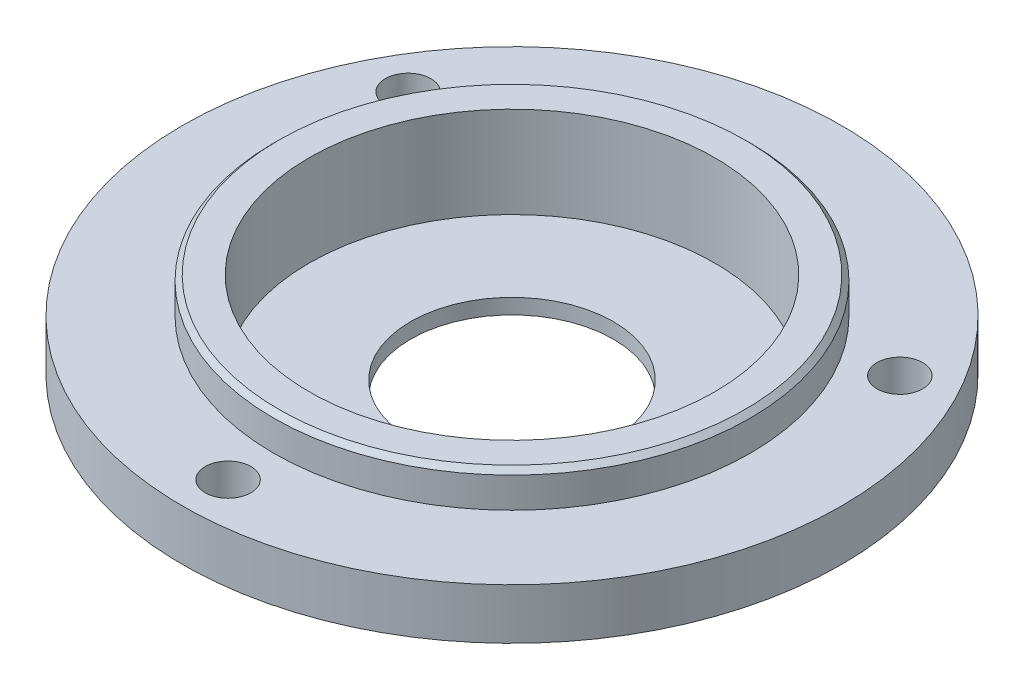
from build123d import *

# Parameters (mm, degrees)
ESQUISSE2_R                  = 2.25
ENL_V_MAT_EXTRU_1_DEPTH      = 47.491934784
R_P_TITION_CIRCULAIRE1_COUNT = 3


with BuildPart() as part:
    # Esquisse1 → R_volution1 (revolve)
    with BuildSketch(Plane.XY):
        Polygon((-10, -7), (-10, -5.5), (-20, -5.5), (-20, 3.5), (-23, 3.5), (-23.5, 3), (-23.5, 0), (-32.5, 0), (-32.5, -5), (-22, -5), (-22, -7), align=None)
    revolve(axis=Axis((0, 39.107095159, 0), (0, -1, 0)))

    # Esquisse2 → Enl_v. mat.-Extru.1 (cut, through all)
    with BuildSketch(Plane(origin=(0, 0, 0), x_dir=(-1, 0, 0), z_dir=(0, 1, 0))):
        with Locations((0, 28)):
            Circle(ESQUISSE2_R)
    enl_v_mat_extru_1 = extrude(amount=-ENL_V_MAT_EXTRU_1_DEPTH, mode=Mode.SUBTRACT)

    # R_p_tition circulaire1: Enl_v. mat.-Extru.1 ×3 about axis
    r_p_tition_circulaire1_axis = Axis((0, 0, 0), (0, 1, 0))
    for i in range(1, R_P_TITION_CIRCULAIRE1_COUNT):
        add(enl_v_mat_extru_1.rotate(r_p_tition_circulaire1_axis, i * 360 / R_P_TITION_CIRCULAIRE1_COUNT), mode=Mode.SUBTRACT)


solid = part.part
